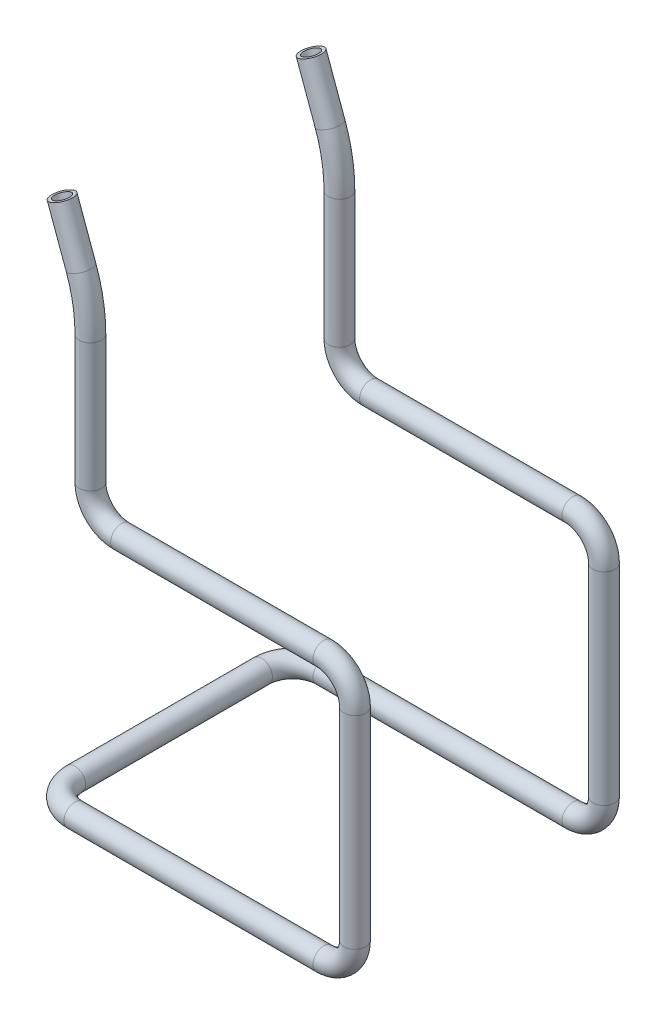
from build123d import *

# Parameters (mm, degrees)
SKETCH1_R   = 3.5
SKETCH1_R_2 = 2.5


with BuildPart() as part:
    # Sweep-Thin1: sweep along a curve in space
    with BuildLine() as sweep_thin1_path:
        Line((0, 0, 0), (0, 0, 30))
        ThreePointArc((10, 0, 40), (2.928932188, 0, 37.071067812), (0, 0, 30))
        Line((10, 0, 40), (90, 0, 40))
        ThreePointArc((100, 10, 40), (97.071067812, 2.928932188, 40), (90, 0, 40))
        Line((100, 10, 40), (100, 75, 40))
        ThreePointArc((90, 85, 40), (97.071067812, 82.071067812, 40), (100, 75, 40))
        Line((90, 85, 40), (25, 85, 40))
        ThreePointArc((15, 95, 40), (17.928932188, 87.928932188, 40), (25, 85, 40))
        Line((15, 95, 40), (15, 136.183650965, 40))
        ThreePointArc((11.984631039, 153.284658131, 40), (14.240387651, 144.866059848, 40), (15, 136.183650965, 40))
        Line((11.984631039, 153.284658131, 40), (5.900744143, 170, 40))
    # Sketch1 → Sweep-Thin1 (sweep)
    with BuildSketch(Plane.XY):
        Circle(SKETCH1_R)
        Circle(SKETCH1_R_2, mode=Mode.SUBTRACT)
    sweep(path=sweep_thin1_path.line)

    # Mirror3: part across plane


with BuildPart() as part_1:
    add(part.part)
    add(part.part.mirror(Plane.XY))


solid = part_1.part
